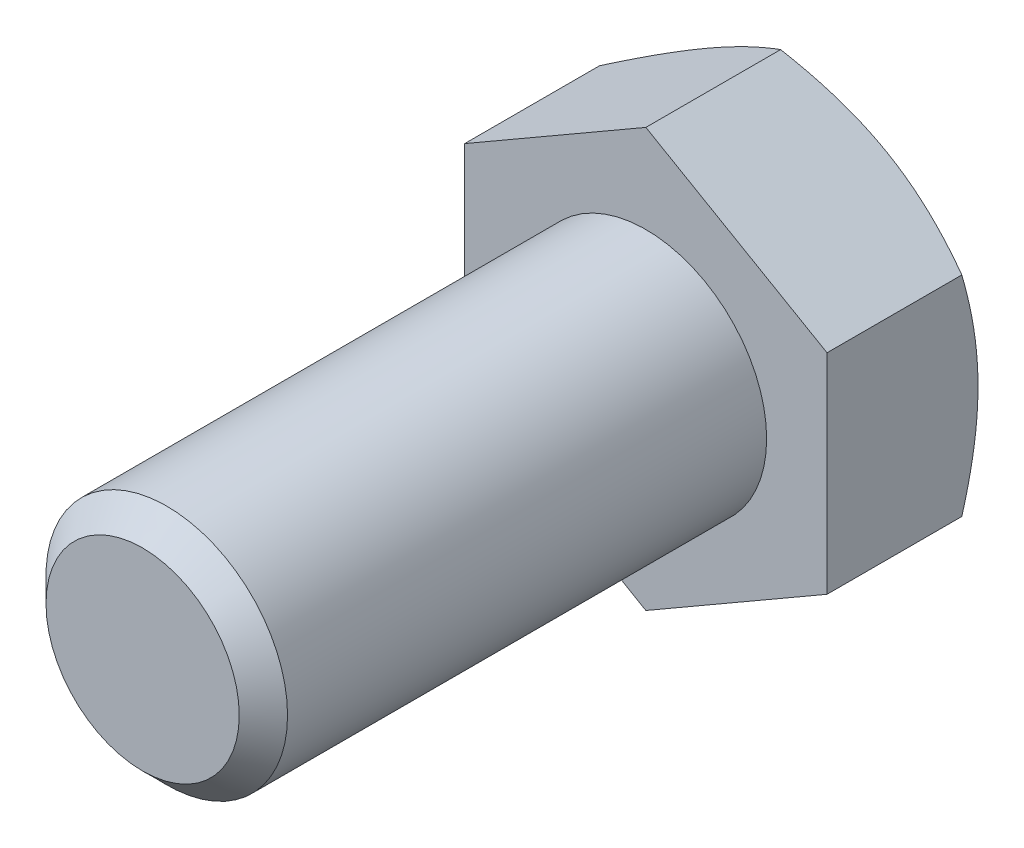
ISO-10303-21;
HEADER;
FILE_DESCRIPTION(('STEP AP214'),'2;1');
FILE_NAME('part.step','',(''),(''),'','','');
FILE_SCHEMA(('AUTOMOTIVE_DESIGN { 1 0 10303 214 1 1 1 1 }'));
ENDSEC;
DATA;
#1=APPLICATION_CONTEXT('core data for automotive mechanical design processes');
#2=APPLICATION_PROTOCOL_DEFINITION('international standard','automotive_design',2000,#1);
#3=PRODUCT_CONTEXT('',#1,'mechanical');
#4=PRODUCT('Part','Part','',(#3));
#5=PRODUCT_RELATED_PRODUCT_CATEGORY('part','',(#4));
#6=PRODUCT_DEFINITION_FORMATION('','',#4);
#7=PRODUCT_DEFINITION_CONTEXT('part definition',#1,'design');
#8=PRODUCT_DEFINITION('design','',#6,#7);
#9=PRODUCT_DEFINITION_SHAPE('','',#8);
#10=(LENGTH_UNIT() NAMED_UNIT(*) SI_UNIT(.MILLI.,.METRE.));
#11=(NAMED_UNIT(*) PLANE_ANGLE_UNIT() SI_UNIT($,.RADIAN.));
#12=(NAMED_UNIT(*) SI_UNIT($,.STERADIAN.) SOLID_ANGLE_UNIT());
#13=UNCERTAINTY_MEASURE_WITH_UNIT(LENGTH_MEASURE(1.E-05),#10,'distance_accuracy_value','');
#14=(GEOMETRIC_REPRESENTATION_CONTEXT(3) GLOBAL_UNCERTAINTY_ASSIGNED_CONTEXT((#13)) GLOBAL_UNIT_ASSIGNED_CONTEXT((#10,
#11,#12)) REPRESENTATION_CONTEXT('',''));
#15=CARTESIAN_POINT('',(0.,0.,0.));
#16=DIRECTION('',(0.,0.,1.));
#17=DIRECTION('',(1.,0.,0.));
#18=AXIS2_PLACEMENT_3D('',#15,#16,#17);
#19=CARTESIAN_POINT('',(0.,0.,25.));
#20=DIRECTION('',(0.,0.,1.));
#21=DIRECTION('',(1.,0.,0.));
#22=AXIS2_PLACEMENT_3D('',#19,#20,#21);
#23=PLANE('',#22);
#24=CARTESIAN_POINT('',(0.,0.,25.));
#25=DIRECTION('',(0.,0.,1.));
#26=DIRECTION('',(1.,0.,0.));
#27=AXIS2_PLACEMENT_3D('',#24,#25,#26);
#28=CIRCLE('',#27,4.80000000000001);
#29=CARTESIAN_POINT('',(4.80000000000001,0.,25.));
#30=VERTEX_POINT('',#29);
#31=EDGE_CURVE('E205',#30,#30,#28,.T.);
#32=ORIENTED_EDGE('',*,*,#31,.T.);
#33=EDGE_LOOP('',(#32));
#34=FACE_BOUND('',#33,.T.);
#35=ADVANCED_FACE('F31',(#34),#23,.T.);
#36=CARTESIAN_POINT('',(0.,0.,0.));
#37=DIRECTION('',(0.,0.,1.));
#38=DIRECTION('',(1.,0.,0.));
#39=AXIS2_PLACEMENT_3D('',#36,#37,#38);
#40=CYLINDRICAL_SURFACE('',#39,6.);
#41=CARTESIAN_POINT('',(0.,0.,23.8));
#42=DIRECTION('',(0.,0.,1.));
#43=DIRECTION('',(1.,0.,0.));
#44=AXIS2_PLACEMENT_3D('',#41,#42,#43);
#45=CIRCLE('',#44,6.);
#46=CARTESIAN_POINT('',(6.,0.,23.8));
#47=VERTEX_POINT('',#46);
#48=EDGE_CURVE('E207',#47,#47,#45,.F.);
#49=ORIENTED_EDGE('',*,*,#48,.T.);
#50=EDGE_LOOP('',(#49));
#51=FACE_BOUND('',#50,.T.);
#52=CARTESIAN_POINT('',(0.,0.,0.));
#53=DIRECTION('',(0.,0.,1.));
#54=DIRECTION('',(1.,0.,0.));
#55=AXIS2_PLACEMENT_3D('',#52,#53,#54);
#56=CIRCLE('',#55,6.);
#57=CARTESIAN_POINT('',(6.,0.,0.));
#58=VERTEX_POINT('',#57);
#59=EDGE_CURVE('E208',#58,#58,#56,.F.);
#60=ORIENTED_EDGE('',*,*,#59,.F.);
#61=EDGE_LOOP('',(#60));
#62=FACE_BOUND('',#61,.T.);
#63=ADVANCED_FACE('F196',(#51,#62),#40,.T.);
#64=CARTESIAN_POINT('',(0.,0.,25.));
#65=DIRECTION('',(0.,0.,-1.));
#66=DIRECTION('',(-1.,0.,0.));
#67=AXIS2_PLACEMENT_3D('',#64,#65,#66);
#68=CONICAL_SURFACE('',#67,4.80000000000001,0.785398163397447);
#69=ORIENTED_EDGE('',*,*,#48,.F.);
#70=EDGE_LOOP('',(#69));
#71=FACE_BOUND('',#70,.T.);
#72=ORIENTED_EDGE('',*,*,#31,.F.);
#73=EDGE_LOOP('',(#72));
#74=FACE_BOUND('',#73,.T.);
#75=ADVANCED_FACE('F201',(#71,#74),#68,.T.);
#76=CARTESIAN_POINT('',(0.,10.3923048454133,-7.5));
#77=DIRECTION('',(0.499999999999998,0.86602540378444,0.));
#78=DIRECTION('',(-0.86602540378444,0.499999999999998,0.));
#79=AXIS2_PLACEMENT_3D('',#76,#77,#78);
#80=PLANE('',#79);
#81=CARTESIAN_POINT('',(-0.00020000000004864,10.3924203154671,-6.69608575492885));
#82=CARTESIAN_POINT('',(0.197607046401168,10.2782163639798,-6.76201799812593));
#83=CARTESIAN_POINT('',(0.396185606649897,10.1635669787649,-6.82495859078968));
#84=CARTESIAN_POINT('',(0.794955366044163,9.93333715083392,-6.94403100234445));
#85=CARTESIAN_POINT('',(0.995147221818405,9.8177563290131,-7.00015988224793));
#86=CARTESIAN_POINT('',(1.39751505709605,9.5854491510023,-7.10484803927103));
#87=CARTESIAN_POINT('',(1.59969459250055,9.46872074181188,-7.15338922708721));
#88=CARTESIAN_POINT('',(2.0054287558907,9.23447001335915,-7.24185148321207));
#89=CARTESIAN_POINT('',(2.20898309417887,9.11694786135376,-7.28177431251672));
#90=CARTESIAN_POINT('',(2.61230590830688,8.88408932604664,-7.35131532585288));
#91=CARTESIAN_POINT('',(2.81204459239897,8.76877014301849,-7.3811624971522));
#92=CARTESIAN_POINT('',(3.21241567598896,8.53761579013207,-7.43120669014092));
#93=CARTESIAN_POINT('',(3.41304799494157,8.42178066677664,-7.45140456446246));
#94=CARTESIAN_POINT('',(3.81466063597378,8.18990950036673,-7.48164565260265));
#95=CARTESIAN_POINT('',(4.0156403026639,8.07387383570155,-7.4917003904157));
#96=CARTESIAN_POINT('',(4.41778459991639,7.84169571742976,-7.50143766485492));
#97=CARTESIAN_POINT('',(4.61894922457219,7.7255532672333,-7.50112052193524));
#98=CARTESIAN_POINT('',(4.99503261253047,7.50842142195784,-7.49083604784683));
#99=CARTESIAN_POINT('',(5.16997789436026,7.40741671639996,-7.4821232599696));
#100=CARTESIAN_POINT('',(5.51945867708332,7.2056438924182,-7.45702265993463));
#101=CARTESIAN_POINT('',(5.69399414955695,7.10487579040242,-7.44063433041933));
#102=CARTESIAN_POINT('',(6.21692487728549,6.80296159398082,-7.38034344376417));
#103=CARTESIAN_POINT('',(6.5643945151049,6.60234990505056,-7.32532251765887));
#104=CARTESIAN_POINT('',(7.26301962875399,6.19899850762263,-7.18776952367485));
#105=CARTESIAN_POINT('',(7.61408594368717,5.99631027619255,-7.10465438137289));
#106=CARTESIAN_POINT('',(8.3109833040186,5.59395639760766,-6.91601746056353));
#107=CARTESIAN_POINT('',(8.65682327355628,5.39428559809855,-6.81053998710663));
#108=CARTESIAN_POINT('',(9.0002,5.19603695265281,-6.69608575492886));
#109=B_SPLINE_CURVE_WITH_KNOTS('',3,(#81,#82,#83,#84,#85,#86,#87,#88,#89,#90,#91,#92,#93,#94,
#95,#96,#97,#98,#99,#100,#101,#102,#103,#104,#105,#106,#107,#108),.UNSPECIFIED.,.F.,.F.,(4,2,2,
2,2,2,2,2,2,2,2,2,2,4),(0.,0.713219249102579,1.42674513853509,2.14194697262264,2.85700253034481,
3.55449749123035,4.25193080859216,4.94857085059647,5.64518936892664,6.25162976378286,
6.85811104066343,8.07193747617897,9.31268391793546,10.5509947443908),.UNSPECIFIED.);
#110=CARTESIAN_POINT('',(0.,10.3923048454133,-6.69615242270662));
#111=VERTEX_POINT('',#110);
#112=CARTESIAN_POINT('',(4.49999999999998,7.79422863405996,-7.5));
#113=VERTEX_POINT('',#112);
#114=EDGE_CURVE('E241',#111,#113,#109,.T.);
#115=ORIENTED_EDGE('',*,*,#114,.F.);
#116=DIRECTION('',(0.,0.,1.));
#117=VECTOR('',#116,1.);
#118=CARTESIAN_POINT('',(0.,10.3923048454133,-7.5));
#119=LINE('',#118,#117);
#120=CARTESIAN_POINT('',(0.,10.3923048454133,0.));
#121=VERTEX_POINT('',#120);
#122=EDGE_CURVE('E215',#111,#121,#119,.T.);
#123=ORIENTED_EDGE('',*,*,#122,.T.);
#124=DIRECTION('',(-0.86602540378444,0.499999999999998,0.));
#125=VECTOR('',#124,1.);
#126=CARTESIAN_POINT('',(0.,10.3923048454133,0.));
#127=LINE('',#126,#125);
#128=CARTESIAN_POINT('',(9.00000000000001,5.19615242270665,0.));
#129=VERTEX_POINT('',#128);
#130=EDGE_CURVE('E239',#129,#121,#127,.T.);
#131=ORIENTED_EDGE('',*,*,#130,.F.);
#132=DIRECTION('',(0.,0.,1.));
#133=VECTOR('',#132,1.);
#134=CARTESIAN_POINT('',(9.00000000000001,5.19615242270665,-7.5));
#135=LINE('',#134,#133);
#136=CARTESIAN_POINT('',(9.00000000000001,5.19615242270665,-6.69615242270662));
#137=VERTEX_POINT('',#136);
#138=EDGE_CURVE('E212',#137,#129,#135,.T.);
#139=ORIENTED_EDGE('',*,*,#138,.F.);
#140=EDGE_CURVE('E171',#113,#137,#109,.T.);
#141=ORIENTED_EDGE('',*,*,#140,.F.);
#142=EDGE_LOOP('',(#115,#123,#131,#139,#141));
#143=FACE_BOUND('',#142,.T.);
#144=ADVANCED_FACE('F181',(#143),#80,.T.);
#145=CARTESIAN_POINT('',(9.00000000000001,-5.19615242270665,-7.5));
#146=DIRECTION('',(1.,0.,0.));
#147=DIRECTION('',(0.,0.,-1.));
#148=AXIS2_PLACEMENT_3D('',#145,#146,#147);
#149=PLANE('',#148);
#150=CARTESIAN_POINT('',(9.00000000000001,-14.1938054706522,-2.99281770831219));
#151=CARTESIAN_POINT('',(9.00000000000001,-13.7986249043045,-3.18545400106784));
#152=CARTESIAN_POINT('',(9.00000000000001,-13.4025620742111,-3.37631016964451));
#153=CARTESIAN_POINT('',(9.00000000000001,-12.6082034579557,-3.75346543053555));
#154=CARTESIAN_POINT('',(9.00000000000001,-12.2099073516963,-3.93976384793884));
#155=CARTESIAN_POINT('',(9.00000000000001,-11.4086732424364,-4.30769386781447));
#156=CARTESIAN_POINT('',(9.00000000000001,-11.005721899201,-4.48929651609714));
#157=CARTESIAN_POINT('',(9.00000000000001,-10.1966954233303,-4.84537774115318));
#158=CARTESIAN_POINT('',(9.00000000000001,-9.79062043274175,-5.01985663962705));
#159=CARTESIAN_POINT('',(9.00000000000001,-8.96081603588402,-5.36560228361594));
#160=CARTESIAN_POINT('',(9.00000000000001,-8.53695616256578,-5.5365575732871));
#161=CARTESIAN_POINT('',(9.00000000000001,-7.68436682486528,-5.86609252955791));
#162=CARTESIAN_POINT('',(9.00000000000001,-7.25563683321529,-6.02467084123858));
#163=CARTESIAN_POINT('',(9.00000000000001,-6.39334839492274,-6.3254614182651));
#164=CARTESIAN_POINT('',(9.00000000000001,-5.95980093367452,-6.46770484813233));
#165=CARTESIAN_POINT('',(9.00000000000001,-5.08650675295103,-6.73142002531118));
#166=CARTESIAN_POINT('',(9.00000000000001,-4.64676195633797,-6.85289806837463));
#167=CARTESIAN_POINT('',(9.00000000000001,-3.7631885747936,-7.06875933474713));
#168=CARTESIAN_POINT('',(9.00000000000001,-3.31939822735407,-7.16329494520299));
#169=CARTESIAN_POINT('',(9.00000000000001,-2.64948950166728,-7.28091249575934));
#170=CARTESIAN_POINT('',(9.00000000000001,-2.42546830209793,-7.31608884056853));
#171=CARTESIAN_POINT('',(9.00000000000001,-1.97623392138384,-7.37769613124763));
#172=CARTESIAN_POINT('',(9.00000000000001,-1.75102085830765,-7.40412792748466));
#173=CARTESIAN_POINT('',(9.00000000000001,-1.30274989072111,-7.44737513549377));
#174=CARTESIAN_POINT('',(9.00000000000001,-1.07970414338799,-7.46431601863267));
#175=CARTESIAN_POINT('',(9.00000000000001,-0.633095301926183,-7.4887410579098));
#176=CARTESIAN_POINT('',(9.00000000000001,-0.409532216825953,-7.49622537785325));
#177=CARTESIAN_POINT('',(9.00000000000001,0.0377121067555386,-7.50155767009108));
#178=CARTESIAN_POINT('',(9.00000000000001,0.261393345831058,-7.49940559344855));
#179=CARTESIAN_POINT('',(9.00000000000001,0.708460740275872,-7.48552018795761));
#180=CARTESIAN_POINT('',(9.00000000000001,0.931846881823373,-7.47378642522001));
#181=CARTESIAN_POINT('',(9.00000000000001,1.46162752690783,-7.43485039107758));
#182=CARTESIAN_POINT('',(9.00000000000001,1.76772399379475,-7.40349650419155));
#183=CARTESIAN_POINT('',(9.00000000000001,2.37778404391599,-7.32445593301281));
#184=CARTESIAN_POINT('',(9.00000000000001,2.6817473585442,-7.27676722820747));
#185=CARTESIAN_POINT('',(9.00000000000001,3.59000335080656,-7.1117163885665));
#186=CARTESIAN_POINT('',(9.00000000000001,4.19036603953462,-6.9723942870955));
#187=CARTESIAN_POINT('',(9.00000000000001,5.08858153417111,-6.72898039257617));
#188=CARTESIAN_POINT('',(9.00000000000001,5.39104017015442,-6.64089135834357));
#189=CARTESIAN_POINT('',(9.00000000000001,5.99302412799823,-6.4551143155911));
#190=CARTESIAN_POINT('',(9.00000000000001,6.29254942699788,-6.35742623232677));
#191=CARTESIAN_POINT('',(9.00000000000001,6.88875586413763,-6.15405553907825));
#192=CARTESIAN_POINT('',(9.00000000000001,7.18543776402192,-6.0483751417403));
#193=CARTESIAN_POINT('',(9.00000000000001,7.77631041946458,-5.83030807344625));
#194=CARTESIAN_POINT('',(9.00000000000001,8.07050123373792,-5.71792156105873));
#195=CARTESIAN_POINT('',(9.00000000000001,8.86768097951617,-5.40462740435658));
#196=CARTESIAN_POINT('',(9.00000000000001,9.36851420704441,-5.19823951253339));
#197=CARTESIAN_POINT('',(9.00000000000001,10.3649647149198,-4.77318997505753));
#198=CARTESIAN_POINT('',(9.00000000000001,10.860581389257,-4.5545269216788));
#199=CARTESIAN_POINT('',(9.00000000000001,11.8478077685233,-4.10785524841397));
#200=CARTESIAN_POINT('',(9.00000000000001,12.3394158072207,-3.87984295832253));
#201=CARTESIAN_POINT('',(9.00000000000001,13.3192435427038,-3.41672758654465));
#202=CARTESIAN_POINT('',(9.00000000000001,13.8074633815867,-3.18162480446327));
#203=CARTESIAN_POINT('',(9.00000000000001,14.7819931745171,-2.70549247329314));
#204=CARTESIAN_POINT('',(9.00000000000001,15.2682986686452,-2.46445381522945));
#205=CARTESIAN_POINT('',(9.00000000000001,16.2387067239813,-1.97797920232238));
#206=CARTESIAN_POINT('',(9.00000000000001,16.7228092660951,-1.73254320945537));
#207=CARTESIAN_POINT('',(9.00000000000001,17.6890969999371,-1.23819989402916));
#208=CARTESIAN_POINT('',(9.00000000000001,18.1712826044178,-0.989293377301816));
#209=CARTESIAN_POINT('',(9.00000000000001,19.1341609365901,-0.48860773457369));
#210=CARTESIAN_POINT('',(9.00000000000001,19.6148536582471,-0.236828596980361));
#211=CARTESIAN_POINT('',(9.00000000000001,20.9522159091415,0.46783942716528));
#212=CARTESIAN_POINT('',(9.00000000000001,21.8075292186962,0.92330168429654));
#213=CARTESIAN_POINT('',(9.00000000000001,23.5152984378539,1.83966951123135));
#214=CARTESIAN_POINT('',(9.00000000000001,24.3677541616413,2.3005754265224));
#215=CARTESIAN_POINT('',(9.00000000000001,26.0675482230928,3.22485857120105));
#216=CARTESIAN_POINT('',(9.00000000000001,26.9148940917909,3.68822195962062));
#217=CARTESIAN_POINT('',(9.00000000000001,28.1846057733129,4.38556367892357));
#218=CARTESIAN_POINT('',(9.00000000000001,28.6076082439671,4.61838432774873));
#219=CARTESIAN_POINT('',(9.00000000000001,29.4532343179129,5.08471147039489));
#220=CARTESIAN_POINT('',(9.00000000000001,29.8758579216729,5.31821796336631));
#221=CARTESIAN_POINT('',(9.00000000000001,30.2983153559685,5.55202477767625));
#222=B_SPLINE_CURVE_WITH_KNOTS('',3,(#150,#151,#152,#153,#154,#155,#156,#157,#158,#159,#160,
#161,#162,#163,#164,#165,#166,#167,#168,#169,#170,#171,#172,#173,#174,#175,#176,#177,#178,#179,
#180,#181,#182,#183,#184,#185,#186,#187,#188,#189,#190,#191,#192,#193,#194,#195,#196,#197,#198,
#199,#200,#201,#202,#203,#204,#205,#206,#207,#208,#209,#210,#211,#212,#213,#214,#215,#216,#217,
#218,#219,#220,#221),.UNSPECIFIED.,.F.,.F.,(4,2,2,2,2,2,2,2,2,2,2,2,2,2,2,2,2,2,2,2,2,2,2,2,2,2,
2,2,2,2,2,2,2,2,2,4),(0.,1.31891143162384,2.63801699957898,3.9639117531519,5.28974656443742,
6.66070766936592,8.03181864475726,9.40026868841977,10.7683030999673,12.1284389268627,
12.8085936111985,13.488682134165,14.1595537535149,14.8304137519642,15.5012771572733,
16.172170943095,17.094749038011,18.0174412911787,19.8637129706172,20.808703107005,
21.7537006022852,22.6984374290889,23.6431519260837,25.267980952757,26.8929966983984,
28.5186565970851,30.1442479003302,31.7725119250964,33.4007900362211,35.0286961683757,
36.6566088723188,39.5636489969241,42.4708746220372,45.3681585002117,46.8166845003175,
48.2652087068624),.UNSPECIFIED.);
#223=CARTESIAN_POINT('',(9.,0.,-7.5));
#224=VERTEX_POINT('',#223);
#225=EDGE_CURVE('E169',#137,#224,#222,.F.);
#226=ORIENTED_EDGE('',*,*,#225,.F.);
#227=ORIENTED_EDGE('',*,*,#138,.T.);
#228=DIRECTION('',(0.,1.,0.));
#229=VECTOR('',#228,1.);
#230=CARTESIAN_POINT('',(9.00000000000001,-5.19615242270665,0.));
#231=LINE('',#230,#229);
#232=CARTESIAN_POINT('',(9.00000000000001,-5.19615242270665,0.));
#233=VERTEX_POINT('',#232);
#234=EDGE_CURVE('E217',#233,#129,#231,.T.);
#235=ORIENTED_EDGE('',*,*,#234,.F.);
#236=DIRECTION('',(0.,0.,1.));
#237=VECTOR('',#236,1.);
#238=CARTESIAN_POINT('',(9.00000000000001,-5.19615242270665,-7.5));
#239=LINE('',#238,#237);
#240=CARTESIAN_POINT('',(9.00000000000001,-5.19615242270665,-6.69615242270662));
#241=VERTEX_POINT('',#240);
#242=EDGE_CURVE('E223',#241,#233,#239,.T.);
#243=ORIENTED_EDGE('',*,*,#242,.F.);
#244=EDGE_CURVE('E164',#224,#241,#222,.F.);
#245=ORIENTED_EDGE('',*,*,#244,.F.);
#246=EDGE_LOOP('',(#226,#227,#235,#243,#245));
#247=FACE_BOUND('',#246,.T.);
#248=ADVANCED_FACE('F177',(#247),#149,.T.);
#249=CARTESIAN_POINT('',(0.,-10.3923048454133,-7.5));
#250=DIRECTION('',(0.499999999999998,-0.86602540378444,0.));
#251=DIRECTION('',(0.86602540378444,0.499999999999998,0.));
#252=AXIS2_PLACEMENT_3D('',#249,#250,#251);
#253=PLANE('',#252);
#254=CARTESIAN_POINT('',(9.0002,-5.19603695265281,-6.69608575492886));
#255=CARTESIAN_POINT('',(8.80239295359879,-5.31024090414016,-6.76201799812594));
#256=CARTESIAN_POINT('',(8.60381439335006,-5.42489028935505,-6.82495859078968));
#257=CARTESIAN_POINT('',(8.20504463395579,-5.65512011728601,-6.94403100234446));
#258=CARTESIAN_POINT('',(8.00485277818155,-5.77070093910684,-7.00015988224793));
#259=CARTESIAN_POINT('',(7.6024849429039,-6.00300811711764,-7.10484803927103));
#260=CARTESIAN_POINT('',(7.4003054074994,-6.11973652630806,-7.15338922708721));
#261=CARTESIAN_POINT('',(6.99457124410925,-6.35398725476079,-7.24185148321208));
#262=CARTESIAN_POINT('',(6.79101690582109,-6.47150940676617,-7.28177431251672));
#263=CARTESIAN_POINT('',(6.38769409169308,-6.70436794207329,-7.35131532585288));
#264=CARTESIAN_POINT('',(6.18795540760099,-6.81968712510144,-7.3811624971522));
#265=CARTESIAN_POINT('',(5.787584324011,-7.05084147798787,-7.43120669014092));
#266=CARTESIAN_POINT('',(5.58695200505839,-7.16667660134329,-7.45140456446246));
#267=CARTESIAN_POINT('',(5.18533936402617,-7.3985477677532,-7.48164565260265));
#268=CARTESIAN_POINT('',(4.98435969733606,-7.51458343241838,-7.4917003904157));
#269=CARTESIAN_POINT('',(4.58221540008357,-7.74676155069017,-7.50143766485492));
#270=CARTESIAN_POINT('',(4.38105077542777,-7.86290400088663,-7.50112052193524));
#271=CARTESIAN_POINT('',(4.00496738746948,-8.08003584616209,-7.49083604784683));
#272=CARTESIAN_POINT('',(3.83002210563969,-8.18104055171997,-7.4821232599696));
#273=CARTESIAN_POINT('',(3.48054132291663,-8.38281337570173,-7.45702265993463));
#274=CARTESIAN_POINT('',(3.30600585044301,-8.48358147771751,-7.44063433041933));
#275=CARTESIAN_POINT('',(2.78307512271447,-8.78549567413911,-7.38034344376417));
#276=CARTESIAN_POINT('',(2.43560548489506,-8.98610736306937,-7.32532251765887));
#277=CARTESIAN_POINT('',(1.73698037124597,-9.38945876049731,-7.18776952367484));
#278=CARTESIAN_POINT('',(1.38591405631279,-9.59214699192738,-7.10465438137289));
#279=CARTESIAN_POINT('',(0.689016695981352,-9.99450087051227,-6.91601746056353));
#280=CARTESIAN_POINT('',(0.343176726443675,-10.1941716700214,-6.81053998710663));
#281=CARTESIAN_POINT('',(-0.000200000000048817,-10.3924203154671,-6.69608575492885));
#282=B_SPLINE_CURVE_WITH_KNOTS('',3,(#254,#255,#256,#257,#258,#259,#260,#261,#262,#263,#264,
#265,#266,#267,#268,#269,#270,#271,#272,#273,#274,#275,#276,#277,#278,#279,#280,#281),
.UNSPECIFIED.,.F.,.F.,(4,2,2,2,2,2,2,2,2,2,2,2,2,4),(0.,0.71321924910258,1.42674513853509,
2.14194697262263,2.85700253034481,3.55449749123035,4.25193080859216,4.94857085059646,
5.64518936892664,6.25162976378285,6.85811104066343,8.07193747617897,9.31268391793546,
10.5509947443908),.UNSPECIFIED.);
#283=CARTESIAN_POINT('',(4.49999999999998,-7.79422863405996,-7.5));
#284=VERTEX_POINT('',#283);
#285=EDGE_CURVE('E170',#241,#284,#282,.T.);
#286=ORIENTED_EDGE('',*,*,#285,.F.);
#287=ORIENTED_EDGE('',*,*,#242,.T.);
#288=DIRECTION('',(0.86602540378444,0.499999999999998,0.));
#289=VECTOR('',#288,1.);
#290=CARTESIAN_POINT('',(0.,-10.3923048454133,0.));
#291=LINE('',#290,#289);
#292=CARTESIAN_POINT('',(0.,-10.3923048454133,0.));
#293=VERTEX_POINT('',#292);
#294=EDGE_CURVE('E228',#293,#233,#291,.T.);
#295=ORIENTED_EDGE('',*,*,#294,.F.);
#296=DIRECTION('',(0.,0.,1.));
#297=VECTOR('',#296,1.);
#298=CARTESIAN_POINT('',(0.,-10.3923048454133,-7.5));
#299=LINE('',#298,#297);
#300=CARTESIAN_POINT('',(0.,-10.3923048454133,-6.69615242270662));
#301=VERTEX_POINT('',#300);
#302=EDGE_CURVE('E221',#301,#293,#299,.T.);
#303=ORIENTED_EDGE('',*,*,#302,.F.);
#304=EDGE_CURVE('E158',#284,#301,#282,.T.);
#305=ORIENTED_EDGE('',*,*,#304,.F.);
#306=EDGE_LOOP('',(#286,#287,#295,#303,#305));
#307=FACE_BOUND('',#306,.T.);
#308=ADVANCED_FACE('F180',(#307),#253,.T.);
#309=CARTESIAN_POINT('',(0.,-10.3923048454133,-7.5));
#310=DIRECTION('',(-0.500000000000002,-0.866025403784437,0.));
#311=DIRECTION('',(0.866025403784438,-0.500000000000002,0.));
#312=AXIS2_PLACEMENT_3D('',#309,#310,#311);
#313=PLANE('',#312);
#314=CARTESIAN_POINT('',(0.000199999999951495,-10.3924203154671,-6.69608575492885));
#315=CARTESIAN_POINT('',(-0.197607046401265,-10.2782163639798,-6.76201799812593));
#316=CARTESIAN_POINT('',(-0.396185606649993,-10.1635669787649,-6.82495859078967));
#317=CARTESIAN_POINT('',(-0.794955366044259,-9.93333715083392,-6.94403100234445));
#318=CARTESIAN_POINT('',(-0.9951472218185,-9.81775632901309,-7.00015988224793));
#319=CARTESIAN_POINT('',(-1.39751505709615,-9.58544915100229,-7.10484803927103));
#320=CARTESIAN_POINT('',(-1.59969459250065,-9.46872074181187,-7.1533892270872));
#321=CARTESIAN_POINT('',(-2.0054287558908,-9.23447001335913,-7.24185148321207));
#322=CARTESIAN_POINT('',(-2.20898309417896,-9.11694786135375,-7.28177431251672));
#323=CARTESIAN_POINT('',(-2.61230590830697,-8.88408932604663,-7.35131532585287));
#324=CARTESIAN_POINT('',(-2.81204459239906,-8.76877014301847,-7.38116249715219));
#325=CARTESIAN_POINT('',(-3.21241567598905,-8.53761579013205,-7.43120669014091));
#326=CARTESIAN_POINT('',(-3.41304799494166,-8.42178066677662,-7.45140456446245));
#327=CARTESIAN_POINT('',(-3.81466063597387,-8.18990950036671,-7.48164565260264));
#328=CARTESIAN_POINT('',(-4.01564030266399,-8.07387383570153,-7.49170039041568));
#329=CARTESIAN_POINT('',(-4.41778459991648,-7.84169571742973,-7.5014376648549));
#330=CARTESIAN_POINT('',(-4.61894922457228,-7.72555326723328,-7.50112052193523));
#331=CARTESIAN_POINT('',(-4.99503261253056,-7.50842142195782,-7.49083604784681));
#332=CARTESIAN_POINT('',(-5.16997789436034,-7.40741671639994,-7.48212325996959));
#333=CARTESIAN_POINT('',(-5.51945867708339,-7.20564389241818,-7.45702265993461));
#334=CARTESIAN_POINT('',(-5.69399414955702,-7.1048757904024,-7.44063433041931));
#335=CARTESIAN_POINT('',(-6.21692487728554,-6.8029615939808,-7.38034344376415));
#336=CARTESIAN_POINT('',(-6.56439451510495,-6.60234990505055,-7.32532251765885));
#337=CARTESIAN_POINT('',(-7.26301962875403,-6.19899850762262,-7.18776952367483));
#338=CARTESIAN_POINT('',(-7.6140859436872,-5.99631027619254,-7.10465438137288));
#339=CARTESIAN_POINT('',(-8.31098330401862,-5.59395639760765,-6.91601746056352));
#340=CARTESIAN_POINT('',(-8.65682327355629,-5.39428559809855,-6.81053998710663));
#341=CARTESIAN_POINT('',(-9.0002,-5.19603695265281,-6.69608575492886));
#342=B_SPLINE_CURVE_WITH_KNOTS('',3,(#314,#315,#316,#317,#318,#319,#320,#321,#322,#323,#324,
#325,#326,#327,#328,#329,#330,#331,#332,#333,#334,#335,#336,#337,#338,#339,#340,#341),
.UNSPECIFIED.,.F.,.F.,(4,2,2,2,2,2,2,2,2,2,2,2,2,4),(0.,0.713219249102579,1.42674513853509,
2.14194697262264,2.85700253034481,3.55449749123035,4.25193080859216,4.94857085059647,
5.64518936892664,6.25162976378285,6.85811104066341,8.07193747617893,9.31268391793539,
10.5509947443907),.UNSPECIFIED.);
#343=CARTESIAN_POINT('',(-4.50000000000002,-7.79422863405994,-7.5));
#344=VERTEX_POINT('',#343);
#345=EDGE_CURVE('E260',#301,#344,#342,.T.);
#346=ORIENTED_EDGE('',*,*,#345,.F.);
#347=ORIENTED_EDGE('',*,*,#302,.T.);
#348=DIRECTION('',(0.866025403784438,-0.500000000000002,0.));
#349=VECTOR('',#348,1.);
#350=CARTESIAN_POINT('',(0.,-10.3923048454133,0.));
#351=LINE('',#350,#349);
#352=CARTESIAN_POINT('',(-9.00000000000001,-5.19615242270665,0.));
#353=VERTEX_POINT('',#352);
#354=EDGE_CURVE('E231',#353,#293,#351,.T.);
#355=ORIENTED_EDGE('',*,*,#354,.F.);
#356=DIRECTION('',(0.,0.,1.));
#357=VECTOR('',#356,1.);
#358=CARTESIAN_POINT('',(-9.00000000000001,-5.19615242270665,-7.5));
#359=LINE('',#358,#357);
#360=CARTESIAN_POINT('',(-9.00000000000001,-5.19615242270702,-6.69615242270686));
#361=VERTEX_POINT('',#360);
#362=EDGE_CURVE('E219',#361,#353,#359,.T.);
#363=ORIENTED_EDGE('',*,*,#362,.F.);
#364=EDGE_CURVE('E107',#344,#361,#342,.T.);
#365=ORIENTED_EDGE('',*,*,#364,.F.);
#366=EDGE_LOOP('',(#346,#347,#355,#363,#365));
#367=FACE_BOUND('',#366,.T.);
#368=ADVANCED_FACE('F185',(#367),#313,.T.);
#369=CARTESIAN_POINT('',(-9.00000000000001,-5.19615242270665,-7.5));
#370=DIRECTION('',(-1.,0.,0.));
#371=DIRECTION('',(0.,0.,1.));
#372=AXIS2_PLACEMENT_3D('',#369,#370,#371);
#373=PLANE('',#372);
#374=CARTESIAN_POINT('',(-9.00000000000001,-14.1938054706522,-2.99281770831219));
#375=CARTESIAN_POINT('',(-9.00000000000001,-13.7986249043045,-3.18545400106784));
#376=CARTESIAN_POINT('',(-9.00000000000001,-13.4025620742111,-3.37631016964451));
#377=CARTESIAN_POINT('',(-9.00000000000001,-12.6082034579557,-3.75346543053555));
#378=CARTESIAN_POINT('',(-9.00000000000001,-12.2099073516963,-3.93976384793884));
#379=CARTESIAN_POINT('',(-9.00000000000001,-11.4086732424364,-4.30769386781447));
#380=CARTESIAN_POINT('',(-9.00000000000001,-11.005721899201,-4.48929651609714));
#381=CARTESIAN_POINT('',(-9.00000000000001,-10.1966954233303,-4.84537774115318));
#382=CARTESIAN_POINT('',(-9.00000000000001,-9.79062043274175,-5.01985663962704));
#383=CARTESIAN_POINT('',(-9.00000000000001,-8.96081603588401,-5.36560228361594));
#384=CARTESIAN_POINT('',(-9.00000000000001,-8.53695616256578,-5.5365575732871));
#385=CARTESIAN_POINT('',(-9.00000000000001,-7.68436682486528,-5.86609252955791));
#386=CARTESIAN_POINT('',(-9.00000000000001,-7.25563683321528,-6.02467084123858));
#387=CARTESIAN_POINT('',(-9.00000000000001,-6.39334839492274,-6.3254614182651));
#388=CARTESIAN_POINT('',(-9.00000000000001,-5.95980093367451,-6.46770484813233));
#389=CARTESIAN_POINT('',(-9.00000000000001,-5.08650675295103,-6.73142002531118));
#390=CARTESIAN_POINT('',(-9.00000000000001,-4.64676195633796,-6.85289806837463));
#391=CARTESIAN_POINT('',(-9.00000000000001,-3.76318857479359,-7.06875933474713));
#392=CARTESIAN_POINT('',(-9.00000000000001,-3.31939822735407,-7.16329494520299));
#393=CARTESIAN_POINT('',(-9.00000000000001,-2.64948950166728,-7.28091249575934));
#394=CARTESIAN_POINT('',(-9.00000000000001,-2.42546830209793,-7.31608884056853));
#395=CARTESIAN_POINT('',(-9.00000000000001,-1.97623392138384,-7.37769613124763));
#396=CARTESIAN_POINT('',(-9.00000000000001,-1.75102085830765,-7.40412792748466));
#397=CARTESIAN_POINT('',(-9.00000000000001,-1.30274989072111,-7.44737513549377));
#398=CARTESIAN_POINT('',(-9.00000000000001,-1.07970414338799,-7.46431601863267));
#399=CARTESIAN_POINT('',(-9.00000000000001,-0.633095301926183,-7.4887410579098));
#400=CARTESIAN_POINT('',(-9.00000000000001,-0.409532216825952,-7.49622537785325));
#401=CARTESIAN_POINT('',(-9.00000000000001,0.0377121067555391,-7.50155767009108));
#402=CARTESIAN_POINT('',(-9.00000000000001,0.261393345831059,-7.49940559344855));
#403=CARTESIAN_POINT('',(-9.00000000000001,0.708460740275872,-7.48552018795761));
#404=CARTESIAN_POINT('',(-9.00000000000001,0.931846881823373,-7.47378642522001));
#405=CARTESIAN_POINT('',(-9.00000000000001,1.46162752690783,-7.43485039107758));
#406=CARTESIAN_POINT('',(-9.00000000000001,1.76772399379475,-7.40349650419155));
#407=CARTESIAN_POINT('',(-9.00000000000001,2.37778404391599,-7.32445593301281));
#408=CARTESIAN_POINT('',(-9.00000000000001,2.6817473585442,-7.27676722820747));
#409=CARTESIAN_POINT('',(-9.00000000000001,3.59000335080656,-7.1117163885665));
#410=CARTESIAN_POINT('',(-9.00000000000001,4.19036603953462,-6.9723942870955));
#411=CARTESIAN_POINT('',(-9.00000000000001,5.08858153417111,-6.72898039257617));
#412=CARTESIAN_POINT('',(-9.00000000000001,5.39104017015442,-6.64089135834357));
#413=CARTESIAN_POINT('',(-9.00000000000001,5.99302412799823,-6.4551143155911));
#414=CARTESIAN_POINT('',(-9.00000000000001,6.29254942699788,-6.35742623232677));
#415=CARTESIAN_POINT('',(-9.00000000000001,6.88875586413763,-6.15405553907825));
#416=CARTESIAN_POINT('',(-9.00000000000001,7.18543776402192,-6.0483751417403));
#417=CARTESIAN_POINT('',(-9.00000000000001,7.77631041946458,-5.83030807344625));
#418=CARTESIAN_POINT('',(-9.00000000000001,8.07050123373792,-5.71792156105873));
#419=CARTESIAN_POINT('',(-9.00000000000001,8.86768097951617,-5.40462740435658));
#420=CARTESIAN_POINT('',(-9.00000000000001,9.36851420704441,-5.19823951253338));
#421=CARTESIAN_POINT('',(-9.00000000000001,10.3649647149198,-4.77318997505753));
#422=CARTESIAN_POINT('',(-9.00000000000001,10.860581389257,-4.55452692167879));
#423=CARTESIAN_POINT('',(-9.00000000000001,11.8478077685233,-4.10785524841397));
#424=CARTESIAN_POINT('',(-9.00000000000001,12.3394158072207,-3.87984295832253));
#425=CARTESIAN_POINT('',(-9.00000000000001,13.3192435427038,-3.41672758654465));
#426=CARTESIAN_POINT('',(-9.00000000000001,13.8074633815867,-3.18162480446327));
#427=CARTESIAN_POINT('',(-9.00000000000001,14.7819931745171,-2.70549247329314));
#428=CARTESIAN_POINT('',(-9.00000000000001,15.2682986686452,-2.46445381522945));
#429=CARTESIAN_POINT('',(-9.00000000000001,16.2387067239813,-1.97797920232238));
#430=CARTESIAN_POINT('',(-9.00000000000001,16.722809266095,-1.73254320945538));
#431=CARTESIAN_POINT('',(-9.00000000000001,17.6890969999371,-1.23819989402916));
#432=CARTESIAN_POINT('',(-9.00000000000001,18.1712826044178,-0.989293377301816));
#433=CARTESIAN_POINT('',(-9.00000000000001,19.1341609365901,-0.48860773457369));
#434=CARTESIAN_POINT('',(-9.00000000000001,19.6148536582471,-0.236828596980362));
#435=CARTESIAN_POINT('',(-9.00000000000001,20.9522159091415,0.467839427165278));
#436=CARTESIAN_POINT('',(-9.00000000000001,21.8075292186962,0.923301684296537));
#437=CARTESIAN_POINT('',(-9.00000000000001,23.5152984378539,1.83966951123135));
#438=CARTESIAN_POINT('',(-9.00000000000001,24.3677541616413,2.3005754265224));
#439=CARTESIAN_POINT('',(-9.00000000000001,26.0675482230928,3.22485857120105));
#440=CARTESIAN_POINT('',(-9.00000000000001,26.9148940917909,3.68822195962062));
#441=CARTESIAN_POINT('',(-9.00000000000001,28.184605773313,4.38556367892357));
#442=CARTESIAN_POINT('',(-9.00000000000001,28.6076082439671,4.61838432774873));
#443=CARTESIAN_POINT('',(-9.00000000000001,29.4532343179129,5.08471147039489));
#444=CARTESIAN_POINT('',(-9.00000000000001,29.8758579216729,5.31821796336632));
#445=CARTESIAN_POINT('',(-9.00000000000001,30.2983153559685,5.55202477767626));
#446=B_SPLINE_CURVE_WITH_KNOTS('',3,(#374,#375,#376,#377,#378,#379,#380,#381,#382,#383,#384,
#385,#386,#387,#388,#389,#390,#391,#392,#393,#394,#395,#396,#397,#398,#399,#400,#401,#402,#403,
#404,#405,#406,#407,#408,#409,#410,#411,#412,#413,#414,#415,#416,#417,#418,#419,#420,#421,#422,
#423,#424,#425,#426,#427,#428,#429,#430,#431,#432,#433,#434,#435,#436,#437,#438,#439,#440,#441,
#442,#443,#444,#445),.UNSPECIFIED.,.F.,.F.,(4,2,2,2,2,2,2,2,2,2,2,2,2,2,2,2,2,2,2,2,2,2,2,2,2,2,
2,2,2,2,2,2,2,2,2,4),(0.,1.31891143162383,2.63801699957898,3.9639117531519,5.28974656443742,
6.66070766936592,8.03181864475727,9.40026868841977,10.7683030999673,12.1284389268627,
12.8085936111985,13.488682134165,14.1595537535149,14.8304137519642,15.5012771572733,
16.172170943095,17.094749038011,18.0174412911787,19.8637129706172,20.808703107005,
21.7537006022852,22.6984374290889,23.6431519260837,25.267980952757,26.8929966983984,
28.5186565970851,30.1442479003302,31.7725119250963,33.400790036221,35.0286961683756,
36.6566088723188,39.5636489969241,42.4708746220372,45.3681585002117,46.8166845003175,
48.2652087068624),.UNSPECIFIED.);
#447=CARTESIAN_POINT('',(-9.00000000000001,0.,-7.5));
#448=VERTEX_POINT('',#447);
#449=EDGE_CURVE('E102',#361,#448,#446,.T.);
#450=ORIENTED_EDGE('',*,*,#449,.F.);
#451=ORIENTED_EDGE('',*,*,#362,.T.);
#452=DIRECTION('',(0.,-1.,0.));
#453=VECTOR('',#452,1.);
#454=CARTESIAN_POINT('',(-9.00000000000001,-5.19615242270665,0.));
#455=LINE('',#454,#453);
#456=CARTESIAN_POINT('',(-9.00000000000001,5.19615242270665,0.));
#457=VERTEX_POINT('',#456);
#458=EDGE_CURVE('E234',#457,#353,#455,.T.);
#459=ORIENTED_EDGE('',*,*,#458,.F.);
#460=DIRECTION('',(0.,0.,1.));
#461=VECTOR('',#460,1.);
#462=CARTESIAN_POINT('',(-9.00000000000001,5.19615242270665,-7.5));
#463=LINE('',#462,#461);
#464=CARTESIAN_POINT('',(-9.00000000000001,5.19615242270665,-6.69615242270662));
#465=VERTEX_POINT('',#464);
#466=EDGE_CURVE('E128',#465,#457,#463,.T.);
#467=ORIENTED_EDGE('',*,*,#466,.F.);
#468=EDGE_CURVE('E111',#448,#465,#446,.T.);
#469=ORIENTED_EDGE('',*,*,#468,.F.);
#470=EDGE_LOOP('',(#450,#451,#459,#467,#469));
#471=FACE_BOUND('',#470,.T.);
#472=ADVANCED_FACE('F126',(#471),#373,.T.);
#473=CARTESIAN_POINT('',(-9.00000000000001,5.19615242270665,-7.5));
#474=DIRECTION('',(-0.500000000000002,0.866025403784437,0.));
#475=DIRECTION('',(-0.866025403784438,-0.500000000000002,0.));
#476=AXIS2_PLACEMENT_3D('',#473,#474,#475);
#477=PLANE('',#476);
#478=CARTESIAN_POINT('',(-9.0002,5.19603695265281,-6.69608575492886));
#479=CARTESIAN_POINT('',(-8.80239295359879,5.31024090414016,-6.76201799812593));
#480=CARTESIAN_POINT('',(-8.60381439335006,5.42489028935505,-6.82495859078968));
#481=CARTESIAN_POINT('',(-8.20504463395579,5.65512011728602,-6.94403100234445));
#482=CARTESIAN_POINT('',(-8.00485277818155,5.77070093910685,-7.00015988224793));
#483=CARTESIAN_POINT('',(-7.6024849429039,6.00300811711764,-7.10484803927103));
#484=CARTESIAN_POINT('',(-7.40030540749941,6.11973652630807,-7.15338922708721));
#485=CARTESIAN_POINT('',(-6.99457124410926,6.3539872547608,-7.24185148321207));
#486=CARTESIAN_POINT('',(-6.79101690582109,6.47150940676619,-7.28177431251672));
#487=CARTESIAN_POINT('',(-6.38769409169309,6.70436794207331,-7.35131532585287));
#488=CARTESIAN_POINT('',(-6.187955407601,6.81968712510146,-7.38116249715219));
#489=CARTESIAN_POINT('',(-5.787584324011,7.05084147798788,-7.43120669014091));
#490=CARTESIAN_POINT('',(-5.58695200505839,7.16667660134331,-7.45140456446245));
#491=CARTESIAN_POINT('',(-5.18533936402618,7.39854776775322,-7.48164565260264));
#492=CARTESIAN_POINT('',(-4.98435969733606,7.5145834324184,-7.49170039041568));
#493=CARTESIAN_POINT('',(-4.58221540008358,7.7467615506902,-7.5014376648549));
#494=CARTESIAN_POINT('',(-4.38105077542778,7.86290400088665,-7.50112052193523));
#495=CARTESIAN_POINT('',(-4.0049673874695,8.08003584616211,-7.49083604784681));
#496=CARTESIAN_POINT('',(-3.83002210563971,8.18104055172,-7.48212325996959));
#497=CARTESIAN_POINT('',(-3.48054132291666,8.38281337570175,-7.45702265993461));
#498=CARTESIAN_POINT('',(-3.30600585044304,8.48358147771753,-7.44063433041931));
#499=CARTESIAN_POINT('',(-2.78307512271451,8.78549567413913,-7.38034344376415));
#500=CARTESIAN_POINT('',(-2.4356054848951,8.98610736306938,-7.32532251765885));
#501=CARTESIAN_POINT('',(-1.73698037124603,9.38945876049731,-7.18776952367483));
#502=CARTESIAN_POINT('',(-1.38591405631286,9.59214699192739,-7.10465438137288));
#503=CARTESIAN_POINT('',(-0.689016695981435,9.99450087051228,-6.91601746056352));
#504=CARTESIAN_POINT('',(-0.343176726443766,10.1941716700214,-6.81053998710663));
#505=CARTESIAN_POINT('',(0.000199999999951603,10.3924203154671,-6.69608575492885));
#506=B_SPLINE_CURVE_WITH_KNOTS('',3,(#478,#479,#480,#481,#482,#483,#484,#485,#486,#487,#488,
#489,#490,#491,#492,#493,#494,#495,#496,#497,#498,#499,#500,#501,#502,#503,#504,#505),
.UNSPECIFIED.,.F.,.F.,(4,2,2,2,2,2,2,2,2,2,2,2,2,4),(0.,0.71321924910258,1.42674513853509,
2.14194697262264,2.85700253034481,3.55449749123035,4.25193080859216,4.94857085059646,
5.64518936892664,6.25162976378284,6.8581110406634,8.07193747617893,9.31268391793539,
10.5509947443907),.UNSPECIFIED.);
#507=CARTESIAN_POINT('',(-4.50000000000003,7.79422863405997,-7.5));
#508=VERTEX_POINT('',#507);
#509=EDGE_CURVE('E117',#465,#508,#506,.T.);
#510=ORIENTED_EDGE('',*,*,#509,.F.);
#511=ORIENTED_EDGE('',*,*,#466,.T.);
#512=DIRECTION('',(-0.866025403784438,-0.500000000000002,0.));
#513=VECTOR('',#512,1.);
#514=CARTESIAN_POINT('',(-9.00000000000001,5.19615242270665,0.));
#515=LINE('',#514,#513);
#516=EDGE_CURVE('E237',#121,#457,#515,.T.);
#517=ORIENTED_EDGE('',*,*,#516,.F.);
#518=ORIENTED_EDGE('',*,*,#122,.F.);
#519=EDGE_CURVE('E119',#508,#111,#506,.T.);
#520=ORIENTED_EDGE('',*,*,#519,.F.);
#521=EDGE_LOOP('',(#510,#511,#517,#518,#520));
#522=FACE_BOUND('',#521,.T.);
#523=ADVANCED_FACE('F193',(#522),#477,.T.);
#524=CARTESIAN_POINT('',(9.00000000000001,5.19615242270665,0.));
#525=DIRECTION('',(0.,0.,1.));
#526=DIRECTION('',(1.,0.,0.));
#527=AXIS2_PLACEMENT_3D('',#524,#525,#526);
#528=PLANE('',#527);
#529=ORIENTED_EDGE('',*,*,#59,.T.);
#530=EDGE_LOOP('',(#529));
#531=FACE_BOUND('',#530,.T.);
#532=ORIENTED_EDGE('',*,*,#130,.T.);
#533=ORIENTED_EDGE('',*,*,#516,.T.);
#534=ORIENTED_EDGE('',*,*,#458,.T.);
#535=ORIENTED_EDGE('',*,*,#354,.T.);
#536=ORIENTED_EDGE('',*,*,#294,.T.);
#537=ORIENTED_EDGE('',*,*,#234,.T.);
#538=EDGE_LOOP('',(#532,#533,#534,#535,#536,#537));
#539=FACE_BOUND('',#538,.T.);
#540=ADVANCED_FACE('F150',(#531,#539),#528,.T.);
#541=CARTESIAN_POINT('',(0.,0.,0.));
#542=DIRECTION('',(0.,0.,1.));
#543=DIRECTION('',(1.,0.,0.));
#544=AXIS2_PLACEMENT_3D('',#541,#542,#543);
#545=CONICAL_SURFACE('',#544,21.9903810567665,1.0471975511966);
#546=ORIENTED_EDGE('',*,*,#140,.T.);
#547=ORIENTED_EDGE('',*,*,#225,.T.);
#548=CARTESIAN_POINT('',(0.,0.,-7.5));
#549=DIRECTION('',(0.,0.,1.));
#550=DIRECTION('',(1.,0.,0.));
#551=AXIS2_PLACEMENT_3D('',#548,#549,#550);
#552=CIRCLE('',#551,9.);
#553=EDGE_CURVE('E34',#113,#224,#552,.F.);
#554=ORIENTED_EDGE('',*,*,#553,.F.);
#555=EDGE_LOOP('',(#546,#547,#554));
#556=FACE_BOUND('',#555,.T.);
#557=ADVANCED_FACE('F250',(#556),#545,.T.);
#558=ORIENTED_EDGE('',*,*,#114,.T.);
#559=EDGE_CURVE('E124',#508,#113,#552,.F.);
#560=ORIENTED_EDGE('',*,*,#559,.F.);
#561=ORIENTED_EDGE('',*,*,#519,.T.);
#562=EDGE_LOOP('',(#558,#560,#561));
#563=FACE_BOUND('',#562,.T.);
#564=ADVANCED_FACE('F149',(#563),#545,.T.);
#565=ORIENTED_EDGE('',*,*,#468,.T.);
#566=ORIENTED_EDGE('',*,*,#509,.T.);
#567=CARTESIAN_POINT('',(0.,0.,-7.5));
#568=DIRECTION('',(0.,0.,-1.));
#569=DIRECTION('',(-1.,0.,0.));
#570=AXIS2_PLACEMENT_3D('',#567,#568,#569);
#571=CIRCLE('',#570,9.00000000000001);
#572=EDGE_CURVE('E52',#448,#508,#571,.T.);
#573=ORIENTED_EDGE('',*,*,#572,.F.);
#574=EDGE_LOOP('',(#565,#566,#573));
#575=FACE_BOUND('',#574,.T.);
#576=ADVANCED_FACE('F115',(#575),#545,.T.);
#577=ORIENTED_EDGE('',*,*,#364,.T.);
#578=ORIENTED_EDGE('',*,*,#449,.T.);
#579=EDGE_CURVE('E104',#344,#448,#552,.F.);
#580=ORIENTED_EDGE('',*,*,#579,.F.);
#581=EDGE_LOOP('',(#577,#578,#580));
#582=FACE_BOUND('',#581,.T.);
#583=ADVANCED_FACE('F103',(#582),#545,.T.);
#584=ORIENTED_EDGE('',*,*,#304,.T.);
#585=ORIENTED_EDGE('',*,*,#345,.T.);
#586=EDGE_CURVE('E39',#284,#344,#552,.F.);
#587=ORIENTED_EDGE('',*,*,#586,.F.);
#588=EDGE_LOOP('',(#584,#585,#587));
#589=FACE_BOUND('',#588,.T.);
#590=ADVANCED_FACE('F262',(#589),#545,.T.);
#591=ORIENTED_EDGE('',*,*,#244,.T.);
#592=ORIENTED_EDGE('',*,*,#285,.T.);
#593=EDGE_CURVE('E11',#224,#284,#552,.F.);
#594=ORIENTED_EDGE('',*,*,#593,.F.);
#595=EDGE_LOOP('',(#591,#592,#594));
#596=FACE_BOUND('',#595,.T.);
#597=ADVANCED_FACE('F257',(#596),#545,.T.);
#598=CARTESIAN_POINT('',(9.00000000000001,5.19615242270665,-7.5));
#599=DIRECTION('',(0.,0.,1.));
#600=DIRECTION('',(1.,0.,0.));
#601=AXIS2_PLACEMENT_3D('',#598,#599,#600);
#602=PLANE('',#601);
#603=ORIENTED_EDGE('',*,*,#553,.T.);
#604=ORIENTED_EDGE('',*,*,#593,.T.);
#605=ORIENTED_EDGE('',*,*,#586,.T.);
#606=ORIENTED_EDGE('',*,*,#579,.T.);
#607=ORIENTED_EDGE('',*,*,#572,.T.);
#608=ORIENTED_EDGE('',*,*,#559,.T.);
#609=EDGE_LOOP('',(#603,#604,#605,#606,#607,#608));
#610=FACE_BOUND('',#609,.T.);
#611=ADVANCED_FACE('F122',(#610),#602,.F.);
#612=CLOSED_SHELL('',(#35,#63,#75,#144,#248,#308,#368,#472,#523,#540,#557,#564,#576,#583,#590,
#597,#611));
#613=MANIFOLD_SOLID_BREP('B2',#612);
#614=ADVANCED_BREP_SHAPE_REPRESENTATION('',(#18,#613),#14);
#615=SHAPE_DEFINITION_REPRESENTATION(#9,#614);
ENDSEC;
END-ISO-10303-21;
